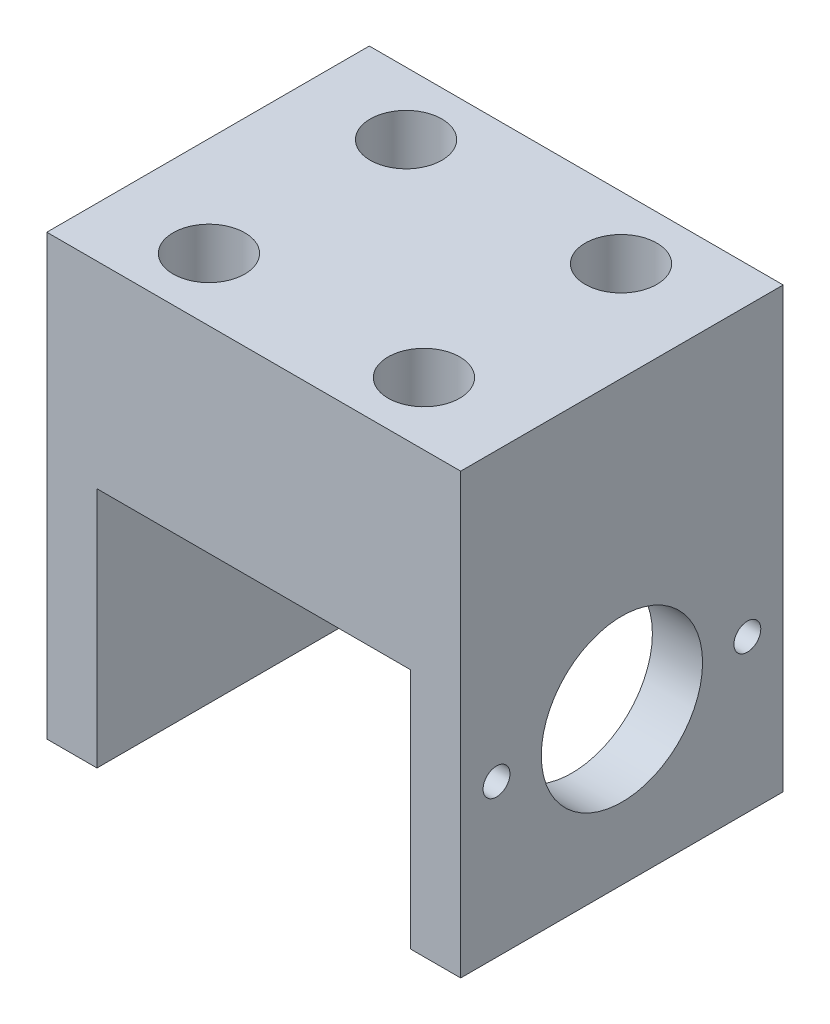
ISO-10303-21;
HEADER;
FILE_DESCRIPTION(('STEP AP214'),'2;1');
FILE_NAME('part.step','',(''),(''),'','','');
FILE_SCHEMA(('AUTOMOTIVE_DESIGN { 1 0 10303 214 1 1 1 1 }'));
ENDSEC;
DATA;
#1=APPLICATION_CONTEXT('core data for automotive mechanical design processes');
#2=APPLICATION_PROTOCOL_DEFINITION('international standard','automotive_design',2000,#1);
#3=PRODUCT_CONTEXT('',#1,'mechanical');
#4=PRODUCT('Part','Part','',(#3));
#5=PRODUCT_RELATED_PRODUCT_CATEGORY('part','',(#4));
#6=PRODUCT_DEFINITION_FORMATION('','',#4);
#7=PRODUCT_DEFINITION_CONTEXT('part definition',#1,'design');
#8=PRODUCT_DEFINITION('design','',#6,#7);
#9=PRODUCT_DEFINITION_SHAPE('','',#8);
#10=(LENGTH_UNIT() NAMED_UNIT(*) SI_UNIT(.MILLI.,.METRE.));
#11=(NAMED_UNIT(*) PLANE_ANGLE_UNIT() SI_UNIT($,.RADIAN.));
#12=(NAMED_UNIT(*) SI_UNIT($,.STERADIAN.) SOLID_ANGLE_UNIT());
#13=UNCERTAINTY_MEASURE_WITH_UNIT(LENGTH_MEASURE(1.E-05),#10,'distance_accuracy_value','');
#14=(GEOMETRIC_REPRESENTATION_CONTEXT(3) GLOBAL_UNCERTAINTY_ASSIGNED_CONTEXT((#13)) GLOBAL_UNIT_ASSIGNED_CONTEXT((#10,
#11,#12)) REPRESENTATION_CONTEXT('',''));
#15=CARTESIAN_POINT('',(0.,0.,0.));
#16=DIRECTION('',(0.,0.,1.));
#17=DIRECTION('',(1.,0.,0.));
#18=AXIS2_PLACEMENT_3D('',#15,#16,#17);
#19=CARTESIAN_POINT('',(-23.1,-49.,-18.));
#20=DIRECTION('',(0.,-1.,0.));
#21=DIRECTION('',(0.,0.,-1.));
#22=AXIS2_PLACEMENT_3D('',#19,#20,#21);
#23=PLANE('',#22);
#24=DIRECTION('',(0.,0.,-1.));
#25=VECTOR('',#24,1.);
#26=CARTESIAN_POINT('',(17.5,-49.,18.));
#27=LINE('',#26,#25);
#28=CARTESIAN_POINT('',(17.5,-49.,18.));
#29=VERTEX_POINT('',#28);
#30=CARTESIAN_POINT('',(17.5,-49.,-18.));
#31=VERTEX_POINT('',#30);
#32=EDGE_CURVE('E90',#29,#31,#27,.T.);
#33=ORIENTED_EDGE('',*,*,#32,.T.);
#34=DIRECTION('',(1.,0.,0.));
#35=VECTOR('',#34,1.);
#36=CARTESIAN_POINT('',(-23.1,-49.,-18.));
#37=LINE('',#36,#35);
#38=CARTESIAN_POINT('',(23.1,-49.,-18.));
#39=VERTEX_POINT('',#38);
#40=EDGE_CURVE('E181',#31,#39,#37,.T.);
#41=ORIENTED_EDGE('',*,*,#40,.T.);
#42=DIRECTION('',(0.,0.,1.));
#43=VECTOR('',#42,1.);
#44=CARTESIAN_POINT('',(23.1,-49.,-18.));
#45=LINE('',#44,#43);
#46=CARTESIAN_POINT('',(23.1,-49.,18.));
#47=VERTEX_POINT('',#46);
#48=EDGE_CURVE('E25',#39,#47,#45,.T.);
#49=ORIENTED_EDGE('',*,*,#48,.T.);
#50=DIRECTION('',(1.,0.,0.));
#51=VECTOR('',#50,1.);
#52=CARTESIAN_POINT('',(-23.1,-49.,18.));
#53=LINE('',#52,#51);
#54=EDGE_CURVE('E104',#29,#47,#53,.T.);
#55=ORIENTED_EDGE('',*,*,#54,.F.);
#56=EDGE_LOOP('',(#33,#41,#49,#55));
#57=FACE_BOUND('',#56,.T.);
#58=ADVANCED_FACE('F16',(#57),#23,.T.);
#59=CARTESIAN_POINT('',(23.1,0.,-18.));
#60=DIRECTION('',(0.,1.,0.));
#61=DIRECTION('',(-1.,0.,0.));
#62=AXIS2_PLACEMENT_3D('',#59,#60,#61);
#63=PLANE('',#62);
#64=CARTESIAN_POINT('',(12.,0.,11.));
#65=DIRECTION('',(0.,1.,0.));
#66=DIRECTION('',(0.,0.,1.));
#67=AXIS2_PLACEMENT_3D('',#64,#65,#66);
#68=CIRCLE('',#67,4.);
#69=CARTESIAN_POINT('',(12.,0.,15.));
#70=VERTEX_POINT('',#69);
#71=EDGE_CURVE('E148',#70,#70,#68,.T.);
#72=ORIENTED_EDGE('',*,*,#71,.F.);
#73=EDGE_LOOP('',(#72));
#74=FACE_BOUND('',#73,.T.);
#75=CARTESIAN_POINT('',(-12.,0.,11.));
#76=DIRECTION('',(0.,1.,0.));
#77=DIRECTION('',(0.,0.,1.));
#78=AXIS2_PLACEMENT_3D('',#75,#76,#77);
#79=CIRCLE('',#78,4.);
#80=CARTESIAN_POINT('',(-12.,0.,15.));
#81=VERTEX_POINT('',#80);
#82=EDGE_CURVE('E138',#81,#81,#79,.T.);
#83=ORIENTED_EDGE('',*,*,#82,.F.);
#84=EDGE_LOOP('',(#83));
#85=FACE_BOUND('',#84,.T.);
#86=CARTESIAN_POINT('',(-12.,0.,-11.));
#87=DIRECTION('',(0.,1.,0.));
#88=DIRECTION('',(0.,0.,1.));
#89=AXIS2_PLACEMENT_3D('',#86,#87,#88);
#90=CIRCLE('',#89,4.);
#91=CARTESIAN_POINT('',(-12.,0.,-7.));
#92=VERTEX_POINT('',#91);
#93=EDGE_CURVE('E135',#92,#92,#90,.T.);
#94=ORIENTED_EDGE('',*,*,#93,.F.);
#95=EDGE_LOOP('',(#94));
#96=FACE_BOUND('',#95,.T.);
#97=CARTESIAN_POINT('',(12.,0.,-11.));
#98=DIRECTION('',(0.,1.,0.));
#99=DIRECTION('',(0.,0.,1.));
#100=AXIS2_PLACEMENT_3D('',#97,#98,#99);
#101=CIRCLE('',#100,4.);
#102=CARTESIAN_POINT('',(12.,0.,-7.));
#103=VERTEX_POINT('',#102);
#104=EDGE_CURVE('E132',#103,#103,#101,.T.);
#105=ORIENTED_EDGE('',*,*,#104,.F.);
#106=EDGE_LOOP('',(#105));
#107=FACE_BOUND('',#106,.T.);
#108=DIRECTION('',(-1.,0.,0.));
#109=VECTOR('',#108,1.);
#110=CARTESIAN_POINT('',(23.1,0.,18.));
#111=LINE('',#110,#109);
#112=CARTESIAN_POINT('',(23.1,0.,18.));
#113=VERTEX_POINT('',#112);
#114=CARTESIAN_POINT('',(-23.1,0.,18.));
#115=VERTEX_POINT('',#114);
#116=EDGE_CURVE('E117',#113,#115,#111,.T.);
#117=ORIENTED_EDGE('',*,*,#116,.F.);
#118=DIRECTION('',(0.,0.,1.));
#119=VECTOR('',#118,1.);
#120=CARTESIAN_POINT('',(23.1,0.,-18.));
#121=LINE('',#120,#119);
#122=CARTESIAN_POINT('',(23.1,0.,-18.));
#123=VERTEX_POINT('',#122);
#124=EDGE_CURVE('E10',#123,#113,#121,.T.);
#125=ORIENTED_EDGE('',*,*,#124,.F.);
#126=DIRECTION('',(-1.,0.,0.));
#127=VECTOR('',#126,1.);
#128=CARTESIAN_POINT('',(23.1,0.,-18.));
#129=LINE('',#128,#127);
#130=CARTESIAN_POINT('',(-23.1,0.,-18.));
#131=VERTEX_POINT('',#130);
#132=EDGE_CURVE('E121',#123,#131,#129,.T.);
#133=ORIENTED_EDGE('',*,*,#132,.T.);
#134=DIRECTION('',(0.,0.,1.));
#135=VECTOR('',#134,1.);
#136=CARTESIAN_POINT('',(-23.1,0.,-18.));
#137=LINE('',#136,#135);
#138=EDGE_CURVE('E66',#131,#115,#137,.T.);
#139=ORIENTED_EDGE('',*,*,#138,.T.);
#140=EDGE_LOOP('',(#117,#125,#133,#139));
#141=FACE_BOUND('',#140,.T.);
#142=ADVANCED_FACE('F18',(#74,#85,#96,#107,#141),#63,.T.);
#143=CARTESIAN_POINT('',(23.1,-49.,-18.));
#144=DIRECTION('',(1.,0.,0.));
#145=DIRECTION('',(0.,1.,0.));
#146=AXIS2_PLACEMENT_3D('',#143,#144,#145);
#147=PLANE('',#146);
#148=CARTESIAN_POINT('',(23.1,-32.,0.));
#149=DIRECTION('',(1.,0.,0.));
#150=DIRECTION('',(0.,0.,-1.));
#151=AXIS2_PLACEMENT_3D('',#148,#149,#150);
#152=CIRCLE('',#151,9.);
#153=CARTESIAN_POINT('',(23.1,-32.,-9.));
#154=VERTEX_POINT('',#153);
#155=EDGE_CURVE('E272',#154,#154,#152,.T.);
#156=ORIENTED_EDGE('',*,*,#155,.F.);
#157=EDGE_LOOP('',(#156));
#158=FACE_BOUND('',#157,.T.);
#159=CARTESIAN_POINT('',(23.1,-32.,14.));
#160=DIRECTION('',(1.,0.,0.));
#161=DIRECTION('',(0.,0.,-1.));
#162=AXIS2_PLACEMENT_3D('',#159,#160,#161);
#163=CIRCLE('',#162,1.49999999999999);
#164=CARTESIAN_POINT('',(23.1,-32.,12.5));
#165=VERTEX_POINT('',#164);
#166=EDGE_CURVE('E131',#165,#165,#163,.T.);
#167=ORIENTED_EDGE('',*,*,#166,.F.);
#168=EDGE_LOOP('',(#167));
#169=FACE_BOUND('',#168,.T.);
#170=CARTESIAN_POINT('',(23.1,-32.,-14.));
#171=DIRECTION('',(1.,0.,0.));
#172=DIRECTION('',(0.,0.,-1.));
#173=AXIS2_PLACEMENT_3D('',#170,#171,#172);
#174=CIRCLE('',#173,1.49999999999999);
#175=CARTESIAN_POINT('',(23.1,-32.,-15.5));
#176=VERTEX_POINT('',#175);
#177=EDGE_CURVE('E159',#176,#176,#174,.T.);
#178=ORIENTED_EDGE('',*,*,#177,.F.);
#179=EDGE_LOOP('',(#178));
#180=FACE_BOUND('',#179,.T.);
#181=DIRECTION('',(0.,1.,0.));
#182=VECTOR('',#181,1.);
#183=CARTESIAN_POINT('',(23.1,-49.,18.));
#184=LINE('',#183,#182);
#185=EDGE_CURVE('E115',#47,#113,#184,.T.);
#186=ORIENTED_EDGE('',*,*,#185,.F.);
#187=ORIENTED_EDGE('',*,*,#48,.F.);
#188=DIRECTION('',(0.,1.,0.));
#189=VECTOR('',#188,1.);
#190=CARTESIAN_POINT('',(23.1,-49.,-18.));
#191=LINE('',#190,#189);
#192=EDGE_CURVE('E127',#39,#123,#191,.T.);
#193=ORIENTED_EDGE('',*,*,#192,.T.);
#194=ORIENTED_EDGE('',*,*,#124,.T.);
#195=EDGE_LOOP('',(#186,#187,#193,#194));
#196=FACE_BOUND('',#195,.T.);
#197=ADVANCED_FACE('F200',(#158,#169,#180,#196),#147,.T.);
#198=DIRECTION('',(0.,0.,-1.));
#199=VECTOR('',#198,1.);
#200=CARTESIAN_POINT('',(-17.5,-49.,18.));
#201=LINE('',#200,#199);
#202=CARTESIAN_POINT('',(-17.5,-49.,18.));
#203=VERTEX_POINT('',#202);
#204=CARTESIAN_POINT('',(-17.5,-49.,-18.));
#205=VERTEX_POINT('',#204);
#206=EDGE_CURVE('E99',#203,#205,#201,.T.);
#207=ORIENTED_EDGE('',*,*,#206,.F.);
#208=CARTESIAN_POINT('',(-23.1,-49.,18.));
#209=VERTEX_POINT('',#208);
#210=EDGE_CURVE('E111',#209,#203,#53,.T.);
#211=ORIENTED_EDGE('',*,*,#210,.F.);
#212=DIRECTION('',(0.,0.,1.));
#213=VECTOR('',#212,1.);
#214=CARTESIAN_POINT('',(-23.1,-49.,-18.));
#215=LINE('',#214,#213);
#216=CARTESIAN_POINT('',(-23.1,-49.,-18.));
#217=VERTEX_POINT('',#216);
#218=EDGE_CURVE('E124',#217,#209,#215,.T.);
#219=ORIENTED_EDGE('',*,*,#218,.F.);
#220=EDGE_CURVE('E182',#217,#205,#37,.T.);
#221=ORIENTED_EDGE('',*,*,#220,.T.);
#222=EDGE_LOOP('',(#207,#211,#219,#221));
#223=FACE_BOUND('',#222,.T.);
#224=ADVANCED_FACE('F191',(#223),#23,.T.);
#225=CARTESIAN_POINT('',(-23.1,0.,-18.));
#226=DIRECTION('',(-1.,0.,0.));
#227=DIRECTION('',(0.,-1.,0.));
#228=AXIS2_PLACEMENT_3D('',#225,#226,#227);
#229=PLANE('',#228);
#230=DIRECTION('',(0.,-1.,0.));
#231=VECTOR('',#230,1.);
#232=CARTESIAN_POINT('',(-23.1,0.,18.));
#233=LINE('',#232,#231);
#234=EDGE_CURVE('E112',#115,#209,#233,.T.);
#235=ORIENTED_EDGE('',*,*,#234,.F.);
#236=ORIENTED_EDGE('',*,*,#138,.F.);
#237=DIRECTION('',(0.,-1.,0.));
#238=VECTOR('',#237,1.);
#239=CARTESIAN_POINT('',(-23.1,0.,-18.));
#240=LINE('',#239,#238);
#241=EDGE_CURVE('E179',#131,#217,#240,.T.);
#242=ORIENTED_EDGE('',*,*,#241,.T.);
#243=ORIENTED_EDGE('',*,*,#218,.T.);
#244=EDGE_LOOP('',(#235,#236,#242,#243));
#245=FACE_BOUND('',#244,.T.);
#246=ADVANCED_FACE('F186',(#245),#229,.T.);
#247=CARTESIAN_POINT('',(0.,0.,-18.));
#248=DIRECTION('',(0.,0.,1.));
#249=DIRECTION('',(1.,0.,0.));
#250=AXIS2_PLACEMENT_3D('',#247,#248,#249);
#251=PLANE('',#250);
#252=ORIENTED_EDGE('',*,*,#40,.F.);
#253=DIRECTION('',(0.,-1.,0.));
#254=VECTOR('',#253,1.);
#255=CARTESIAN_POINT('',(17.5,-22.,-18.));
#256=LINE('',#255,#254);
#257=CARTESIAN_POINT('',(17.5,-22.,-18.));
#258=VERTEX_POINT('',#257);
#259=EDGE_CURVE('E95',#258,#31,#256,.T.);
#260=ORIENTED_EDGE('',*,*,#259,.F.);
#261=DIRECTION('',(1.,0.,0.));
#262=VECTOR('',#261,1.);
#263=CARTESIAN_POINT('',(-17.5,-22.,-18.));
#264=LINE('',#263,#262);
#265=CARTESIAN_POINT('',(-17.5,-22.,-18.));
#266=VERTEX_POINT('',#265);
#267=EDGE_CURVE('E108',#266,#258,#264,.T.);
#268=ORIENTED_EDGE('',*,*,#267,.F.);
#269=DIRECTION('',(0.,1.,0.));
#270=VECTOR('',#269,1.);
#271=CARTESIAN_POINT('',(-17.5,-49.,-18.));
#272=LINE('',#271,#270);
#273=EDGE_CURVE('E168',#205,#266,#272,.T.);
#274=ORIENTED_EDGE('',*,*,#273,.F.);
#275=ORIENTED_EDGE('',*,*,#220,.F.);
#276=ORIENTED_EDGE('',*,*,#241,.F.);
#277=ORIENTED_EDGE('',*,*,#132,.F.);
#278=ORIENTED_EDGE('',*,*,#192,.F.);
#279=EDGE_LOOP('',(#252,#260,#268,#274,#275,#276,#277,#278));
#280=FACE_BOUND('',#279,.T.);
#281=ADVANCED_FACE('F198',(#280),#251,.F.);
#282=CARTESIAN_POINT('',(0.,0.,18.));
#283=DIRECTION('',(0.,0.,1.));
#284=DIRECTION('',(1.,0.,0.));
#285=AXIS2_PLACEMENT_3D('',#282,#283,#284);
#286=PLANE('',#285);
#287=DIRECTION('',(0.,-1.,0.));
#288=VECTOR('',#287,1.);
#289=CARTESIAN_POINT('',(17.5,-22.,18.));
#290=LINE('',#289,#288);
#291=CARTESIAN_POINT('',(17.5,-22.,18.));
#292=VERTEX_POINT('',#291);
#293=EDGE_CURVE('E93',#292,#29,#290,.T.);
#294=ORIENTED_EDGE('',*,*,#293,.T.);
#295=ORIENTED_EDGE('',*,*,#54,.T.);
#296=ORIENTED_EDGE('',*,*,#185,.T.);
#297=ORIENTED_EDGE('',*,*,#116,.T.);
#298=ORIENTED_EDGE('',*,*,#234,.T.);
#299=ORIENTED_EDGE('',*,*,#210,.T.);
#300=DIRECTION('',(0.,1.,0.));
#301=VECTOR('',#300,1.);
#302=CARTESIAN_POINT('',(-17.5,-49.,18.));
#303=LINE('',#302,#301);
#304=CARTESIAN_POINT('',(-17.5,-22.,18.));
#305=VERTEX_POINT('',#304);
#306=EDGE_CURVE('E107',#203,#305,#303,.T.);
#307=ORIENTED_EDGE('',*,*,#306,.T.);
#308=DIRECTION('',(1.,0.,0.));
#309=VECTOR('',#308,1.);
#310=CARTESIAN_POINT('',(-17.5,-22.,18.));
#311=LINE('',#310,#309);
#312=EDGE_CURVE('E33',#305,#292,#311,.T.);
#313=ORIENTED_EDGE('',*,*,#312,.T.);
#314=EDGE_LOOP('',(#294,#295,#296,#297,#298,#299,#307,#313));
#315=FACE_BOUND('',#314,.T.);
#316=ADVANCED_FACE('F102',(#315),#286,.T.);
#317=CARTESIAN_POINT('',(17.5,-22.,18.));
#318=DIRECTION('',(1.,0.,0.));
#319=DIRECTION('',(0.,0.,-1.));
#320=AXIS2_PLACEMENT_3D('',#317,#318,#319);
#321=PLANE('',#320);
#322=CARTESIAN_POINT('',(17.5,-32.,0.));
#323=DIRECTION('',(1.,0.,0.));
#324=DIRECTION('',(0.,0.,-1.));
#325=AXIS2_PLACEMENT_3D('',#322,#323,#324);
#326=CIRCLE('',#325,9.);
#327=CARTESIAN_POINT('',(17.5,-32.,-9.));
#328=VERTEX_POINT('',#327);
#329=EDGE_CURVE('E270',#328,#328,#326,.T.);
#330=ORIENTED_EDGE('',*,*,#329,.T.);
#331=EDGE_LOOP('',(#330));
#332=FACE_BOUND('',#331,.T.);
#333=CARTESIAN_POINT('',(17.5,-32.,14.));
#334=DIRECTION('',(1.,0.,0.));
#335=DIRECTION('',(0.,0.,-1.));
#336=AXIS2_PLACEMENT_3D('',#333,#334,#335);
#337=CIRCLE('',#336,1.5);
#338=CARTESIAN_POINT('',(17.5,-32.,12.5));
#339=VERTEX_POINT('',#338);
#340=EDGE_CURVE('E156',#339,#339,#337,.T.);
#341=ORIENTED_EDGE('',*,*,#340,.T.);
#342=EDGE_LOOP('',(#341));
#343=FACE_BOUND('',#342,.T.);
#344=CARTESIAN_POINT('',(17.5,-32.,-14.));
#345=DIRECTION('',(1.,0.,0.));
#346=DIRECTION('',(0.,0.,-1.));
#347=AXIS2_PLACEMENT_3D('',#344,#345,#346);
#348=CIRCLE('',#347,1.5);
#349=CARTESIAN_POINT('',(17.5,-32.,-15.5));
#350=VERTEX_POINT('',#349);
#351=EDGE_CURVE('E162',#350,#350,#348,.T.);
#352=ORIENTED_EDGE('',*,*,#351,.T.);
#353=EDGE_LOOP('',(#352));
#354=FACE_BOUND('',#353,.T.);
#355=ORIENTED_EDGE('',*,*,#259,.T.);
#356=ORIENTED_EDGE('',*,*,#32,.F.);
#357=ORIENTED_EDGE('',*,*,#293,.F.);
#358=DIRECTION('',(0.,0.,-1.));
#359=VECTOR('',#358,1.);
#360=CARTESIAN_POINT('',(17.5,-22.,18.));
#361=LINE('',#360,#359);
#362=EDGE_CURVE('E173',#292,#258,#361,.T.);
#363=ORIENTED_EDGE('',*,*,#362,.T.);
#364=EDGE_LOOP('',(#355,#356,#357,#363));
#365=FACE_BOUND('',#364,.T.);
#366=ADVANCED_FACE('F92',(#332,#343,#354,#365),#321,.F.);
#367=CARTESIAN_POINT('',(-17.5,-22.,18.));
#368=DIRECTION('',(0.,1.,0.));
#369=DIRECTION('',(0.,0.,1.));
#370=AXIS2_PLACEMENT_3D('',#367,#368,#369);
#371=PLANE('',#370);
#372=CARTESIAN_POINT('',(12.,-22.,11.));
#373=DIRECTION('',(0.,1.,0.));
#374=DIRECTION('',(0.,0.,1.));
#375=AXIS2_PLACEMENT_3D('',#372,#373,#374);
#376=CIRCLE('',#375,4.);
#377=CARTESIAN_POINT('',(12.,-22.,15.));
#378=VERTEX_POINT('',#377);
#379=EDGE_CURVE('E20',#378,#378,#376,.T.);
#380=ORIENTED_EDGE('',*,*,#379,.T.);
#381=EDGE_LOOP('',(#380));
#382=FACE_BOUND('',#381,.T.);
#383=CARTESIAN_POINT('',(-12.,-22.,11.));
#384=DIRECTION('',(0.,1.,0.));
#385=DIRECTION('',(0.,0.,1.));
#386=AXIS2_PLACEMENT_3D('',#383,#384,#385);
#387=CIRCLE('',#386,4.);
#388=CARTESIAN_POINT('',(-12.,-22.,15.));
#389=VERTEX_POINT('',#388);
#390=EDGE_CURVE('E136',#389,#389,#387,.T.);
#391=ORIENTED_EDGE('',*,*,#390,.T.);
#392=EDGE_LOOP('',(#391));
#393=FACE_BOUND('',#392,.T.);
#394=CARTESIAN_POINT('',(-12.,-22.,-11.));
#395=DIRECTION('',(0.,1.,0.));
#396=DIRECTION('',(0.,0.,1.));
#397=AXIS2_PLACEMENT_3D('',#394,#395,#396);
#398=CIRCLE('',#397,4.);
#399=CARTESIAN_POINT('',(-12.,-22.,-7.));
#400=VERTEX_POINT('',#399);
#401=EDGE_CURVE('E133',#400,#400,#398,.T.);
#402=ORIENTED_EDGE('',*,*,#401,.T.);
#403=EDGE_LOOP('',(#402));
#404=FACE_BOUND('',#403,.T.);
#405=CARTESIAN_POINT('',(12.,-22.,-11.));
#406=DIRECTION('',(0.,1.,0.));
#407=DIRECTION('',(0.,0.,1.));
#408=AXIS2_PLACEMENT_3D('',#405,#406,#407);
#409=CIRCLE('',#408,4.);
#410=CARTESIAN_POINT('',(12.,-22.,-7.));
#411=VERTEX_POINT('',#410);
#412=EDGE_CURVE('E128',#411,#411,#409,.T.);
#413=ORIENTED_EDGE('',*,*,#412,.T.);
#414=EDGE_LOOP('',(#413));
#415=FACE_BOUND('',#414,.T.);
#416=ORIENTED_EDGE('',*,*,#267,.T.);
#417=ORIENTED_EDGE('',*,*,#362,.F.);
#418=ORIENTED_EDGE('',*,*,#312,.F.);
#419=DIRECTION('',(0.,0.,-1.));
#420=VECTOR('',#419,1.);
#421=CARTESIAN_POINT('',(-17.5,-22.,18.));
#422=LINE('',#421,#420);
#423=EDGE_CURVE('E175',#305,#266,#422,.T.);
#424=ORIENTED_EDGE('',*,*,#423,.T.);
#425=EDGE_LOOP('',(#416,#417,#418,#424));
#426=FACE_BOUND('',#425,.T.);
#427=ADVANCED_FACE('F196',(#382,#393,#404,#415,#426),#371,.F.);
#428=CARTESIAN_POINT('',(-17.5,-49.,18.));
#429=DIRECTION('',(-1.,0.,0.));
#430=DIRECTION('',(0.,0.,1.));
#431=AXIS2_PLACEMENT_3D('',#428,#429,#430);
#432=PLANE('',#431);
#433=ORIENTED_EDGE('',*,*,#273,.T.);
#434=ORIENTED_EDGE('',*,*,#423,.F.);
#435=ORIENTED_EDGE('',*,*,#306,.F.);
#436=ORIENTED_EDGE('',*,*,#206,.T.);
#437=EDGE_LOOP('',(#433,#434,#435,#436));
#438=FACE_BOUND('',#437,.T.);
#439=ADVANCED_FACE('F193',(#438),#432,.F.);
#440=CARTESIAN_POINT('',(23.1,-32.,-14.));
#441=DIRECTION('',(1.,0.,0.));
#442=DIRECTION('',(0.,0.,-1.));
#443=AXIS2_PLACEMENT_3D('',#440,#441,#442);
#444=CYLINDRICAL_SURFACE('',#443,1.5);
#445=ORIENTED_EDGE('',*,*,#351,.F.);
#446=EDGE_LOOP('',(#445));
#447=FACE_BOUND('',#446,.T.);
#448=ORIENTED_EDGE('',*,*,#177,.T.);
#449=EDGE_LOOP('',(#448));
#450=FACE_BOUND('',#449,.T.);
#451=ADVANCED_FACE('F235',(#447,#450),#444,.F.);
#452=CARTESIAN_POINT('',(23.1,-32.,14.));
#453=DIRECTION('',(1.,0.,0.));
#454=DIRECTION('',(0.,0.,-1.));
#455=AXIS2_PLACEMENT_3D('',#452,#453,#454);
#456=CYLINDRICAL_SURFACE('',#455,1.5);
#457=ORIENTED_EDGE('',*,*,#340,.F.);
#458=EDGE_LOOP('',(#457));
#459=FACE_BOUND('',#458,.T.);
#460=ORIENTED_EDGE('',*,*,#166,.T.);
#461=EDGE_LOOP('',(#460));
#462=FACE_BOUND('',#461,.T.);
#463=ADVANCED_FACE('F241',(#459,#462),#456,.F.);
#464=CARTESIAN_POINT('',(12.,0.,-11.));
#465=DIRECTION('',(0.,1.,0.));
#466=DIRECTION('',(0.,0.,1.));
#467=AXIS2_PLACEMENT_3D('',#464,#465,#466);
#468=CYLINDRICAL_SURFACE('',#467,4.);
#469=ORIENTED_EDGE('',*,*,#104,.T.);
#470=EDGE_LOOP('',(#469));
#471=FACE_BOUND('',#470,.T.);
#472=ORIENTED_EDGE('',*,*,#412,.F.);
#473=EDGE_LOOP('',(#472));
#474=FACE_BOUND('',#473,.T.);
#475=ADVANCED_FACE('F245',(#471,#474),#468,.F.);
#476=CARTESIAN_POINT('',(-12.,0.,-11.));
#477=DIRECTION('',(0.,1.,0.));
#478=DIRECTION('',(0.,0.,1.));
#479=AXIS2_PLACEMENT_3D('',#476,#477,#478);
#480=CYLINDRICAL_SURFACE('',#479,4.);
#481=ORIENTED_EDGE('',*,*,#93,.T.);
#482=EDGE_LOOP('',(#481));
#483=FACE_BOUND('',#482,.T.);
#484=ORIENTED_EDGE('',*,*,#401,.F.);
#485=EDGE_LOOP('',(#484));
#486=FACE_BOUND('',#485,.T.);
#487=ADVANCED_FACE('F249',(#483,#486),#480,.F.);
#488=CARTESIAN_POINT('',(-12.,0.,11.));
#489=DIRECTION('',(0.,1.,0.));
#490=DIRECTION('',(0.,0.,1.));
#491=AXIS2_PLACEMENT_3D('',#488,#489,#490);
#492=CYLINDRICAL_SURFACE('',#491,4.);
#493=ORIENTED_EDGE('',*,*,#82,.T.);
#494=EDGE_LOOP('',(#493));
#495=FACE_BOUND('',#494,.T.);
#496=ORIENTED_EDGE('',*,*,#390,.F.);
#497=EDGE_LOOP('',(#496));
#498=FACE_BOUND('',#497,.T.);
#499=ADVANCED_FACE('F253',(#495,#498),#492,.F.);
#500=CARTESIAN_POINT('',(12.,0.,11.));
#501=DIRECTION('',(0.,1.,0.));
#502=DIRECTION('',(0.,0.,1.));
#503=AXIS2_PLACEMENT_3D('',#500,#501,#502);
#504=CYLINDRICAL_SURFACE('',#503,4.);
#505=ORIENTED_EDGE('',*,*,#71,.T.);
#506=EDGE_LOOP('',(#505));
#507=FACE_BOUND('',#506,.T.);
#508=ORIENTED_EDGE('',*,*,#379,.F.);
#509=EDGE_LOOP('',(#508));
#510=FACE_BOUND('',#509,.T.);
#511=ADVANCED_FACE('F257',(#507,#510),#504,.F.);
#512=CARTESIAN_POINT('',(23.1,-32.,0.));
#513=DIRECTION('',(1.,0.,0.));
#514=DIRECTION('',(0.,0.,-1.));
#515=AXIS2_PLACEMENT_3D('',#512,#513,#514);
#516=CYLINDRICAL_SURFACE('',#515,9.);
#517=ORIENTED_EDGE('',*,*,#329,.F.);
#518=EDGE_LOOP('',(#517));
#519=FACE_BOUND('',#518,.T.);
#520=ORIENTED_EDGE('',*,*,#155,.T.);
#521=EDGE_LOOP('',(#520));
#522=FACE_BOUND('',#521,.T.);
#523=ADVANCED_FACE('F260',(#519,#522),#516,.F.);
#524=CLOSED_SHELL('',(#58,#142,#197,#224,#246,#281,#316,#366,#427,#439,#451,#463,#475,#487,#499,
#511,#523));
#525=MANIFOLD_SOLID_BREP('B1',#524);
#526=ADVANCED_BREP_SHAPE_REPRESENTATION('',(#18,#525),#14);
#527=SHAPE_DEFINITION_REPRESENTATION(#9,#526);
ENDSEC;
END-ISO-10303-21;
